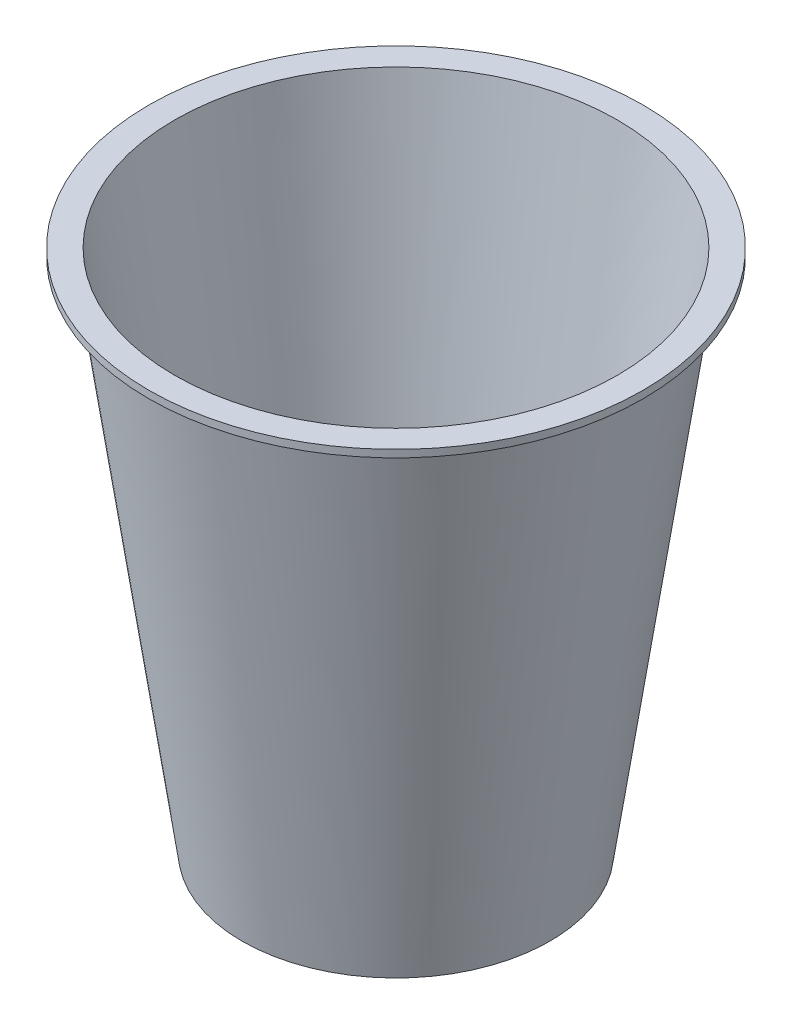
ISO-10303-21;
HEADER;
FILE_DESCRIPTION(('STEP AP214'),'2;1');
FILE_NAME('part.step','',(''),(''),'','','');
FILE_SCHEMA(('AUTOMOTIVE_DESIGN { 1 0 10303 214 1 1 1 1 }'));
ENDSEC;
DATA;
#1=APPLICATION_CONTEXT('core data for automotive mechanical design processes');
#2=APPLICATION_PROTOCOL_DEFINITION('international standard','automotive_design',2000,#1);
#3=PRODUCT_CONTEXT('',#1,'mechanical');
#4=PRODUCT('Part','Part','',(#3));
#5=PRODUCT_RELATED_PRODUCT_CATEGORY('part','',(#4));
#6=PRODUCT_DEFINITION_FORMATION('','',#4);
#7=PRODUCT_DEFINITION_CONTEXT('part definition',#1,'design');
#8=PRODUCT_DEFINITION('design','',#6,#7);
#9=PRODUCT_DEFINITION_SHAPE('','',#8);
#10=(LENGTH_UNIT() NAMED_UNIT(*) SI_UNIT(.MILLI.,.METRE.));
#11=(NAMED_UNIT(*) PLANE_ANGLE_UNIT() SI_UNIT($,.RADIAN.));
#12=(NAMED_UNIT(*) SI_UNIT($,.STERADIAN.) SOLID_ANGLE_UNIT());
#13=UNCERTAINTY_MEASURE_WITH_UNIT(LENGTH_MEASURE(1.E-05),#10,'distance_accuracy_value','');
#14=(GEOMETRIC_REPRESENTATION_CONTEXT(3) GLOBAL_UNCERTAINTY_ASSIGNED_CONTEXT((#13)) GLOBAL_UNIT_ASSIGNED_CONTEXT((#10,
#11,#12)) REPRESENTATION_CONTEXT('',''));
#15=CARTESIAN_POINT('',(0.,0.,0.));
#16=DIRECTION('',(0.,0.,1.));
#17=DIRECTION('',(1.,0.,0.));
#18=AXIS2_PLACEMENT_3D('',#15,#16,#17);
#19=CARTESIAN_POINT('',(-20.,-1.,0.));
#20=DIRECTION('',(0.,1.,0.));
#21=DIRECTION('',(0.,0.,1.));
#22=AXIS2_PLACEMENT_3D('',#19,#20,#21);
#23=PLANE('',#22);
#24=CARTESIAN_POINT('',(0.,-1.,0.));
#25=DIRECTION('',(0.,-1.,0.));
#26=DIRECTION('',(0.,0.,-1.));
#27=AXIS2_PLACEMENT_3D('',#24,#25,#26);
#28=CIRCLE('',#27,20.8672954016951);
#29=CARTESIAN_POINT('',(0.,-1.,-20.8672954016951));
#30=VERTEX_POINT('',#29);
#31=EDGE_CURVE('E10',#30,#30,#28,.T.);
#32=ORIENTED_EDGE('',*,*,#31,.T.);
#33=EDGE_LOOP('',(#32));
#34=FACE_BOUND('',#33,.T.);
#35=ADVANCED_FACE('F22',(#34),#23,.F.);
#36=CARTESIAN_POINT('',(0.,69.,0.));
#37=DIRECTION('',(0.,1.,0.));
#38=DIRECTION('',(0.,0.,1.));
#39=AXIS2_PLACEMENT_3D('',#36,#37,#38);
#40=CONICAL_SURFACE('',#39,30.8672954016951,0.141897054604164);
#41=ORIENTED_EDGE('',*,*,#31,.F.);
#42=EDGE_LOOP('',(#41));
#43=FACE_BOUND('',#42,.T.);
#44=CARTESIAN_POINT('',(0.,69.,0.));
#45=DIRECTION('',(0.,-1.,0.));
#46=DIRECTION('',(0.,0.,-1.));
#47=AXIS2_PLACEMENT_3D('',#44,#45,#46);
#48=CIRCLE('',#47,30.8672954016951);
#49=CARTESIAN_POINT('',(0.,69.,-30.8672954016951));
#50=VERTEX_POINT('',#49);
#51=EDGE_CURVE('E28',#50,#50,#48,.T.);
#52=ORIENTED_EDGE('',*,*,#51,.T.);
#53=EDGE_LOOP('',(#52));
#54=FACE_BOUND('',#53,.T.);
#55=ADVANCED_FACE('F60',(#43,#54),#40,.T.);
#56=CARTESIAN_POINT('',(-33.5,69.,0.));
#57=DIRECTION('',(0.,1.,0.));
#58=DIRECTION('',(0.,0.,1.));
#59=AXIS2_PLACEMENT_3D('',#56,#57,#58);
#60=PLANE('',#59);
#61=ORIENTED_EDGE('',*,*,#51,.F.);
#62=EDGE_LOOP('',(#61));
#63=FACE_BOUND('',#62,.T.);
#64=CARTESIAN_POINT('',(0.,69.,0.));
#65=DIRECTION('',(0.,-1.,0.));
#66=DIRECTION('',(0.,0.,-1.));
#67=AXIS2_PLACEMENT_3D('',#64,#65,#66);
#68=CIRCLE('',#67,33.5);
#69=CARTESIAN_POINT('',(0.,69.,-33.5));
#70=VERTEX_POINT('',#69);
#71=EDGE_CURVE('E32',#70,#70,#68,.T.);
#72=ORIENTED_EDGE('',*,*,#71,.T.);
#73=EDGE_LOOP('',(#72));
#74=FACE_BOUND('',#73,.T.);
#75=ADVANCED_FACE('F64',(#63,#74),#60,.F.);
#76=CARTESIAN_POINT('',(0.,0.,0.));
#77=DIRECTION('',(0.,-1.,0.));
#78=DIRECTION('',(0.,0.,-1.));
#79=AXIS2_PLACEMENT_3D('',#76,#77,#78);
#80=CYLINDRICAL_SURFACE('',#79,33.5);
#81=CARTESIAN_POINT('',(0.,70.,0.));
#82=DIRECTION('',(0.,-1.,0.));
#83=DIRECTION('',(0.,0.,-1.));
#84=AXIS2_PLACEMENT_3D('',#81,#82,#83);
#85=CIRCLE('',#84,33.5);
#86=CARTESIAN_POINT('',(0.,70.,-33.5));
#87=VERTEX_POINT('',#86);
#88=EDGE_CURVE('E36',#87,#87,#85,.T.);
#89=ORIENTED_EDGE('',*,*,#88,.T.);
#90=EDGE_LOOP('',(#89));
#91=FACE_BOUND('',#90,.T.);
#92=ORIENTED_EDGE('',*,*,#71,.F.);
#93=EDGE_LOOP('',(#92));
#94=FACE_BOUND('',#93,.T.);
#95=ADVANCED_FACE('F69',(#91,#94),#80,.T.);
#96=CARTESIAN_POINT('',(-33.5,70.,0.));
#97=DIRECTION('',(0.,1.,0.));
#98=DIRECTION('',(0.,0.,1.));
#99=AXIS2_PLACEMENT_3D('',#96,#97,#98);
#100=PLANE('',#99);
#101=CARTESIAN_POINT('',(0.,70.,0.));
#102=DIRECTION('',(0.,-1.,0.));
#103=DIRECTION('',(0.,0.,-1.));
#104=AXIS2_PLACEMENT_3D('',#101,#102,#103);
#105=CIRCLE('',#104,30.);
#106=CARTESIAN_POINT('',(0.,70.,-30.));
#107=VERTEX_POINT('',#106);
#108=EDGE_CURVE('E41',#107,#107,#105,.T.);
#109=ORIENTED_EDGE('',*,*,#108,.T.);
#110=EDGE_LOOP('',(#109));
#111=FACE_BOUND('',#110,.T.);
#112=ORIENTED_EDGE('',*,*,#88,.F.);
#113=EDGE_LOOP('',(#112));
#114=FACE_BOUND('',#113,.T.);
#115=ADVANCED_FACE('F57',(#111,#114),#100,.T.);
#116=CARTESIAN_POINT('',(0.,70.,0.));
#117=DIRECTION('',(0.,1.,0.));
#118=DIRECTION('',(0.,0.,1.));
#119=AXIS2_PLACEMENT_3D('',#116,#117,#118);
#120=CONICAL_SURFACE('',#119,30.,0.141897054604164);
#121=CARTESIAN_POINT('',(0.,0.,0.));
#122=DIRECTION('',(0.,-1.,0.));
#123=DIRECTION('',(0.,0.,-1.));
#124=AXIS2_PLACEMENT_3D('',#121,#122,#123);
#125=CIRCLE('',#124,20.);
#126=CARTESIAN_POINT('',(0.,0.,-20.));
#127=VERTEX_POINT('',#126);
#128=EDGE_CURVE('E44',#127,#127,#125,.T.);
#129=ORIENTED_EDGE('',*,*,#128,.T.);
#130=EDGE_LOOP('',(#129));
#131=FACE_BOUND('',#130,.T.);
#132=ORIENTED_EDGE('',*,*,#108,.F.);
#133=EDGE_LOOP('',(#132));
#134=FACE_BOUND('',#133,.T.);
#135=ADVANCED_FACE('F48',(#131,#134),#120,.F.);
#136=CARTESIAN_POINT('',(-20.,0.,0.));
#137=DIRECTION('',(0.,1.,0.));
#138=DIRECTION('',(0.,0.,1.));
#139=AXIS2_PLACEMENT_3D('',#136,#137,#138);
#140=PLANE('',#139);
#141=ORIENTED_EDGE('',*,*,#128,.F.);
#142=EDGE_LOOP('',(#141));
#143=FACE_BOUND('',#142,.T.);
#144=ADVANCED_FACE('F51',(#143),#140,.T.);
#145=CLOSED_SHELL('',(#35,#55,#75,#95,#115,#135,#144));
#146=MANIFOLD_SOLID_BREP('B2',#145);
#147=ADVANCED_BREP_SHAPE_REPRESENTATION('',(#18,#146),#14);
#148=SHAPE_DEFINITION_REPRESENTATION(#9,#147);
ENDSEC;
END-ISO-10303-21;
